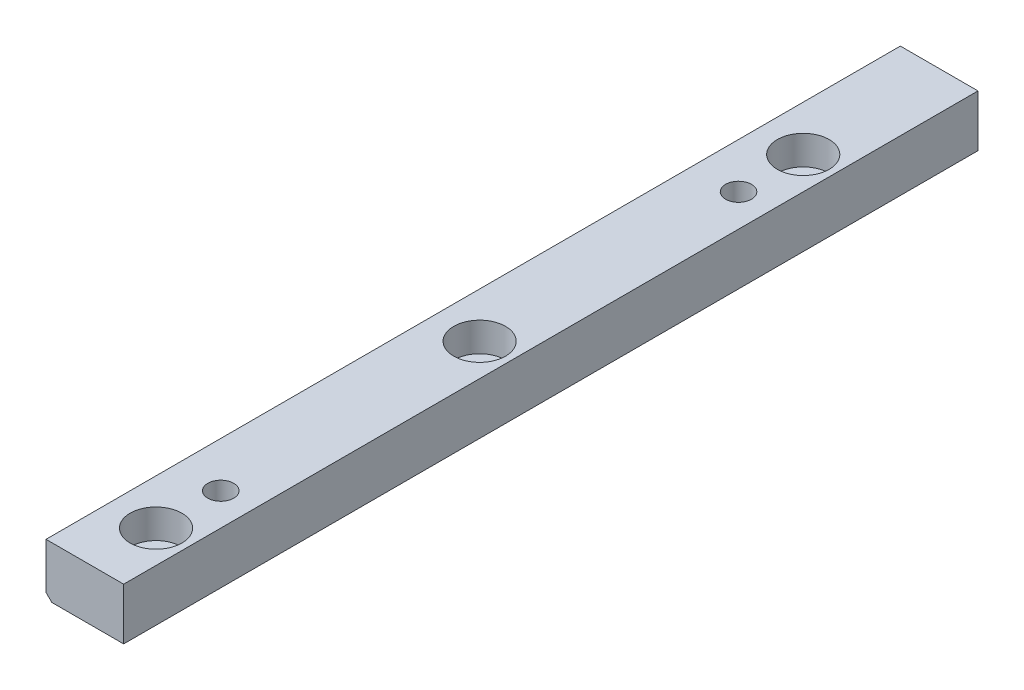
ISO-10303-21;
HEADER;
FILE_DESCRIPTION(('STEP AP214'),'2;1');
FILE_NAME('part.step','',(''),(''),'','','');
FILE_SCHEMA(('AUTOMOTIVE_DESIGN { 1 0 10303 214 1 1 1 1 }'));
ENDSEC;
DATA;
#1=APPLICATION_CONTEXT('core data for automotive mechanical design processes');
#2=APPLICATION_PROTOCOL_DEFINITION('international standard','automotive_design',2000,#1);
#3=PRODUCT_CONTEXT('',#1,'mechanical');
#4=PRODUCT('Part','Part','',(#3));
#5=PRODUCT_RELATED_PRODUCT_CATEGORY('part','',(#4));
#6=PRODUCT_DEFINITION_FORMATION('','',#4);
#7=PRODUCT_DEFINITION_CONTEXT('part definition',#1,'design');
#8=PRODUCT_DEFINITION('design','',#6,#7);
#9=PRODUCT_DEFINITION_SHAPE('','',#8);
#10=(LENGTH_UNIT() NAMED_UNIT(*) SI_UNIT(.MILLI.,.METRE.));
#11=(NAMED_UNIT(*) PLANE_ANGLE_UNIT() SI_UNIT($,.RADIAN.));
#12=(NAMED_UNIT(*) SI_UNIT($,.STERADIAN.) SOLID_ANGLE_UNIT());
#13=UNCERTAINTY_MEASURE_WITH_UNIT(LENGTH_MEASURE(1.E-05),#10,'distance_accuracy_value','');
#14=(GEOMETRIC_REPRESENTATION_CONTEXT(3) GLOBAL_UNCERTAINTY_ASSIGNED_CONTEXT((#13)) GLOBAL_UNIT_ASSIGNED_CONTEXT((#10,
#11,#12)) REPRESENTATION_CONTEXT('',''));
#15=CARTESIAN_POINT('',(0.,0.,0.));
#16=DIRECTION('',(0.,0.,1.));
#17=DIRECTION('',(1.,0.,0.));
#18=AXIS2_PLACEMENT_3D('',#15,#16,#17);
#19=CARTESIAN_POINT('',(7.,-124.,122.));
#20=DIRECTION('',(0.,1.,0.));
#21=DIRECTION('',(0.,0.,1.));
#22=AXIS2_PLACEMENT_3D('',#19,#20,#21);
#23=CYLINDRICAL_SURFACE('',#22,2.25);
#24=CARTESIAN_POINT('',(7.,0.,122.));
#25=DIRECTION('',(0.,1.,0.));
#26=DIRECTION('',(0.,0.,1.));
#27=AXIS2_PLACEMENT_3D('',#24,#25,#26);
#28=CIRCLE('',#27,2.25);
#29=CARTESIAN_POINT('',(7.,0.,124.25));
#30=VERTEX_POINT('',#29);
#31=EDGE_CURVE('E158',#30,#30,#28,.T.);
#32=ORIENTED_EDGE('',*,*,#31,.F.);
#33=EDGE_LOOP('',(#32));
#34=FACE_BOUND('',#33,.T.);
#35=CARTESIAN_POINT('',(7.,3.5,122.));
#36=DIRECTION('',(0.,1.,0.));
#37=DIRECTION('',(0.,0.,1.));
#38=AXIS2_PLACEMENT_3D('',#35,#36,#37);
#39=CIRCLE('',#38,2.25);
#40=CARTESIAN_POINT('',(7.,3.5,124.25));
#41=VERTEX_POINT('',#40);
#42=EDGE_CURVE('E36',#41,#41,#39,.F.);
#43=ORIENTED_EDGE('',*,*,#42,.F.);
#44=EDGE_LOOP('',(#43));
#45=FACE_BOUND('',#44,.T.);
#46=ADVANCED_FACE('F32',(#34,#45),#23,.F.);
#47=CARTESIAN_POINT('',(7.,-124.,72.));
#48=DIRECTION('',(0.,1.,0.));
#49=DIRECTION('',(0.,0.,1.));
#50=AXIS2_PLACEMENT_3D('',#47,#48,#49);
#51=CYLINDRICAL_SURFACE('',#50,2.25);
#52=CARTESIAN_POINT('',(7.,0.,72.));
#53=DIRECTION('',(0.,1.,0.));
#54=DIRECTION('',(0.,0.,1.));
#55=AXIS2_PLACEMENT_3D('',#52,#53,#54);
#56=CIRCLE('',#55,2.25);
#57=CARTESIAN_POINT('',(7.,0.,74.25));
#58=VERTEX_POINT('',#57);
#59=EDGE_CURVE('E161',#58,#58,#56,.T.);
#60=ORIENTED_EDGE('',*,*,#59,.F.);
#61=EDGE_LOOP('',(#60));
#62=FACE_BOUND('',#61,.T.);
#63=CARTESIAN_POINT('',(7.,3.5,72.));
#64=DIRECTION('',(0.,1.,0.));
#65=DIRECTION('',(0.,0.,1.));
#66=AXIS2_PLACEMENT_3D('',#63,#64,#65);
#67=CIRCLE('',#66,2.25);
#68=CARTESIAN_POINT('',(7.,3.5,74.25));
#69=VERTEX_POINT('',#68);
#70=EDGE_CURVE('E126',#69,#69,#67,.F.);
#71=ORIENTED_EDGE('',*,*,#70,.F.);
#72=EDGE_LOOP('',(#71));
#73=FACE_BOUND('',#72,.T.);
#74=ADVANCED_FACE('F187',(#62,#73),#51,.F.);
#75=CARTESIAN_POINT('',(7.,-124.,22.));
#76=DIRECTION('',(0.,1.,0.));
#77=DIRECTION('',(0.,0.,1.));
#78=AXIS2_PLACEMENT_3D('',#75,#76,#77);
#79=CYLINDRICAL_SURFACE('',#78,2.25);
#80=CARTESIAN_POINT('',(7.,0.,22.));
#81=DIRECTION('',(0.,1.,0.));
#82=DIRECTION('',(0.,0.,1.));
#83=AXIS2_PLACEMENT_3D('',#80,#81,#82);
#84=CIRCLE('',#83,2.25);
#85=CARTESIAN_POINT('',(7.,0.,24.25));
#86=VERTEX_POINT('',#85);
#87=EDGE_CURVE('E113',#86,#86,#84,.T.);
#88=ORIENTED_EDGE('',*,*,#87,.F.);
#89=EDGE_LOOP('',(#88));
#90=FACE_BOUND('',#89,.T.);
#91=CARTESIAN_POINT('',(7.,3.5,22.));
#92=DIRECTION('',(0.,1.,0.));
#93=DIRECTION('',(0.,0.,1.));
#94=AXIS2_PLACEMENT_3D('',#91,#92,#93);
#95=CIRCLE('',#94,2.25);
#96=CARTESIAN_POINT('',(7.,3.5,24.25));
#97=VERTEX_POINT('',#96);
#98=EDGE_CURVE('E122',#97,#97,#95,.F.);
#99=ORIENTED_EDGE('',*,*,#98,.F.);
#100=EDGE_LOOP('',(#99));
#101=FACE_BOUND('',#100,.T.);
#102=ADVANCED_FACE('F193',(#90,#101),#79,.F.);
#103=CARTESIAN_POINT('',(0.,0.900000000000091,132.));
#104=DIRECTION('',(0.707106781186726,0.707106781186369,0.));
#105=DIRECTION('',(-0.707106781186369,0.707106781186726,0.));
#106=AXIS2_PLACEMENT_3D('',#103,#104,#105);
#107=PLANE('',#106);
#108=DIRECTION('',(0.707106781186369,-0.707106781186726,0.));
#109=VECTOR('',#108,1.);
#110=CARTESIAN_POINT('',(0.,0.900000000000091,0.));
#111=LINE('',#110,#109);
#112=CARTESIAN_POINT('',(0.,0.900000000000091,0.));
#113=VERTEX_POINT('',#112);
#114=CARTESIAN_POINT('',(0.899999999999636,0.,0.));
#115=VERTEX_POINT('',#114);
#116=EDGE_CURVE('E109',#113,#115,#111,.T.);
#117=ORIENTED_EDGE('',*,*,#116,.T.);
#118=DIRECTION('',(0.,0.,-1.));
#119=VECTOR('',#118,1.);
#120=CARTESIAN_POINT('',(0.899999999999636,0.,132.));
#121=LINE('',#120,#119);
#122=CARTESIAN_POINT('',(0.899999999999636,0.,132.));
#123=VERTEX_POINT('',#122);
#124=EDGE_CURVE('E11',#123,#115,#121,.T.);
#125=ORIENTED_EDGE('',*,*,#124,.F.);
#126=DIRECTION('',(0.707106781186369,-0.707106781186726,0.));
#127=VECTOR('',#126,1.);
#128=CARTESIAN_POINT('',(0.,0.900000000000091,132.));
#129=LINE('',#128,#127);
#130=CARTESIAN_POINT('',(0.,0.900000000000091,132.));
#131=VERTEX_POINT('',#130);
#132=EDGE_CURVE('E118',#131,#123,#129,.T.);
#133=ORIENTED_EDGE('',*,*,#132,.F.);
#134=DIRECTION('',(0.,0.,-1.));
#135=VECTOR('',#134,1.);
#136=CARTESIAN_POINT('',(0.,0.900000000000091,132.));
#137=LINE('',#136,#135);
#138=EDGE_CURVE('E105',#131,#113,#137,.T.);
#139=ORIENTED_EDGE('',*,*,#138,.T.);
#140=EDGE_LOOP('',(#117,#125,#133,#139));
#141=FACE_BOUND('',#140,.T.);
#142=ADVANCED_FACE('F34',(#141),#107,.F.);
#143=CARTESIAN_POINT('',(0.899999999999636,0.,132.));
#144=DIRECTION('',(0.,1.,0.));
#145=DIRECTION('',(0.,0.,1.));
#146=AXIS2_PLACEMENT_3D('',#143,#144,#145);
#147=PLANE('',#146);
#148=CARTESIAN_POINT('',(7.,0.,112.));
#149=DIRECTION('',(0.,1.,0.));
#150=DIRECTION('',(0.,0.,1.));
#151=AXIS2_PLACEMENT_3D('',#148,#149,#150);
#152=CIRCLE('',#151,2.00000000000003);
#153=CARTESIAN_POINT('',(7.,0.,114.));
#154=VERTEX_POINT('',#153);
#155=EDGE_CURVE('E149',#154,#154,#152,.T.);
#156=ORIENTED_EDGE('',*,*,#155,.T.);
#157=EDGE_LOOP('',(#156));
#158=FACE_BOUND('',#157,.T.);
#159=CARTESIAN_POINT('',(7.,0.,32.));
#160=DIRECTION('',(0.,1.,0.));
#161=DIRECTION('',(0.,0.,1.));
#162=AXIS2_PLACEMENT_3D('',#159,#160,#161);
#163=CIRCLE('',#162,2.00000000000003);
#164=CARTESIAN_POINT('',(7.,0.,34.));
#165=VERTEX_POINT('',#164);
#166=EDGE_CURVE('E155',#165,#165,#163,.T.);
#167=ORIENTED_EDGE('',*,*,#166,.T.);
#168=EDGE_LOOP('',(#167));
#169=FACE_BOUND('',#168,.T.);
#170=ORIENTED_EDGE('',*,*,#31,.T.);
#171=EDGE_LOOP('',(#170));
#172=FACE_BOUND('',#171,.T.);
#173=ORIENTED_EDGE('',*,*,#59,.T.);
#174=EDGE_LOOP('',(#173));
#175=FACE_BOUND('',#174,.T.);
#176=ORIENTED_EDGE('',*,*,#87,.T.);
#177=EDGE_LOOP('',(#176));
#178=FACE_BOUND('',#177,.T.);
#179=DIRECTION('',(1.,0.,0.));
#180=VECTOR('',#179,1.);
#181=CARTESIAN_POINT('',(0.899999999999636,0.,0.));
#182=LINE('',#181,#180);
#183=CARTESIAN_POINT('',(11.9999999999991,0.,0.));
#184=VERTEX_POINT('',#183);
#185=EDGE_CURVE('E112',#115,#184,#182,.T.);
#186=ORIENTED_EDGE('',*,*,#185,.T.);
#187=DIRECTION('',(0.,0.,-1.));
#188=VECTOR('',#187,1.);
#189=CARTESIAN_POINT('',(11.9999999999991,0.,132.));
#190=LINE('',#189,#188);
#191=CARTESIAN_POINT('',(11.9999999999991,0.,132.));
#192=VERTEX_POINT('',#191);
#193=EDGE_CURVE('E42',#192,#184,#190,.T.);
#194=ORIENTED_EDGE('',*,*,#193,.F.);
#195=DIRECTION('',(1.,0.,0.));
#196=VECTOR('',#195,1.);
#197=CARTESIAN_POINT('',(0.899999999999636,0.,132.));
#198=LINE('',#197,#196);
#199=EDGE_CURVE('E85',#123,#192,#198,.T.);
#200=ORIENTED_EDGE('',*,*,#199,.F.);
#201=ORIENTED_EDGE('',*,*,#124,.T.);
#202=EDGE_LOOP('',(#186,#194,#200,#201));
#203=FACE_BOUND('',#202,.T.);
#204=ADVANCED_FACE('F170',(#158,#169,#172,#175,#178,#203),#147,.F.);
#205=CARTESIAN_POINT('',(11.9999999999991,0.,132.));
#206=DIRECTION('',(-1.,0.,0.));
#207=DIRECTION('',(0.,0.,1.));
#208=AXIS2_PLACEMENT_3D('',#205,#206,#207);
#209=PLANE('',#208);
#210=DIRECTION('',(0.,1.,0.));
#211=VECTOR('',#210,1.);
#212=CARTESIAN_POINT('',(11.9999999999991,0.,0.));
#213=LINE('',#212,#211);
#214=CARTESIAN_POINT('',(11.9999999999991,8.,0.));
#215=VERTEX_POINT('',#214);
#216=EDGE_CURVE('E100',#184,#215,#213,.T.);
#217=ORIENTED_EDGE('',*,*,#216,.T.);
#218=DIRECTION('',(0.,0.,-1.));
#219=VECTOR('',#218,1.);
#220=CARTESIAN_POINT('',(11.9999999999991,8.,132.));
#221=LINE('',#220,#219);
#222=CARTESIAN_POINT('',(11.9999999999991,8.,132.));
#223=VERTEX_POINT('',#222);
#224=EDGE_CURVE('E97',#223,#215,#221,.T.);
#225=ORIENTED_EDGE('',*,*,#224,.F.);
#226=DIRECTION('',(0.,1.,0.));
#227=VECTOR('',#226,1.);
#228=CARTESIAN_POINT('',(11.9999999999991,0.,132.));
#229=LINE('',#228,#227);
#230=EDGE_CURVE('E89',#192,#223,#229,.T.);
#231=ORIENTED_EDGE('',*,*,#230,.F.);
#232=ORIENTED_EDGE('',*,*,#193,.T.);
#233=EDGE_LOOP('',(#217,#225,#231,#232));
#234=FACE_BOUND('',#233,.T.);
#235=ADVANCED_FACE('F98',(#234),#209,.F.);
#236=CARTESIAN_POINT('',(-9.09494701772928E-13,8.,132.));
#237=DIRECTION('',(0.,-1.,0.));
#238=DIRECTION('',(0.,0.,-1.));
#239=AXIS2_PLACEMENT_3D('',#236,#237,#238);
#240=PLANE('',#239);
#241=CARTESIAN_POINT('',(7.,8.,122.));
#242=DIRECTION('',(0.,1.,0.));
#243=DIRECTION('',(0.,0.,1.));
#244=AXIS2_PLACEMENT_3D('',#241,#242,#243);
#245=CIRCLE('',#244,4.);
#246=CARTESIAN_POINT('',(7.,8.,126.));
#247=VERTEX_POINT('',#246);
#248=EDGE_CURVE('E142',#247,#247,#245,.T.);
#249=ORIENTED_EDGE('',*,*,#248,.F.);
#250=EDGE_LOOP('',(#249));
#251=FACE_BOUND('',#250,.T.);
#252=CARTESIAN_POINT('',(7.,8.,72.));
#253=DIRECTION('',(0.,1.,0.));
#254=DIRECTION('',(0.,0.,1.));
#255=AXIS2_PLACEMENT_3D('',#252,#253,#254);
#256=CIRCLE('',#255,4.);
#257=CARTESIAN_POINT('',(7.,8.,76.));
#258=VERTEX_POINT('',#257);
#259=EDGE_CURVE('E135',#258,#258,#256,.T.);
#260=ORIENTED_EDGE('',*,*,#259,.F.);
#261=EDGE_LOOP('',(#260));
#262=FACE_BOUND('',#261,.T.);
#263=CARTESIAN_POINT('',(7.,8.,22.));
#264=DIRECTION('',(0.,1.,0.));
#265=DIRECTION('',(0.,0.,1.));
#266=AXIS2_PLACEMENT_3D('',#263,#264,#265);
#267=CIRCLE('',#266,4.);
#268=CARTESIAN_POINT('',(7.,8.,26.));
#269=VERTEX_POINT('',#268);
#270=EDGE_CURVE('E128',#269,#269,#267,.T.);
#271=ORIENTED_EDGE('',*,*,#270,.F.);
#272=EDGE_LOOP('',(#271));
#273=FACE_BOUND('',#272,.T.);
#274=CARTESIAN_POINT('',(7.,8.,112.));
#275=DIRECTION('',(0.,1.,0.));
#276=DIRECTION('',(0.,0.,1.));
#277=AXIS2_PLACEMENT_3D('',#274,#275,#276);
#278=CIRCLE('',#277,2.00000000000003);
#279=CARTESIAN_POINT('',(7.,8.,114.));
#280=VERTEX_POINT('',#279);
#281=EDGE_CURVE('E124',#280,#280,#278,.T.);
#282=ORIENTED_EDGE('',*,*,#281,.F.);
#283=EDGE_LOOP('',(#282));
#284=FACE_BOUND('',#283,.T.);
#285=CARTESIAN_POINT('',(7.,8.,32.));
#286=DIRECTION('',(0.,1.,0.));
#287=DIRECTION('',(0.,0.,1.));
#288=AXIS2_PLACEMENT_3D('',#285,#286,#287);
#289=CIRCLE('',#288,2.00000000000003);
#290=CARTESIAN_POINT('',(7.,8.,34.));
#291=VERTEX_POINT('',#290);
#292=EDGE_CURVE('E152',#291,#291,#289,.T.);
#293=ORIENTED_EDGE('',*,*,#292,.F.);
#294=EDGE_LOOP('',(#293));
#295=FACE_BOUND('',#294,.T.);
#296=DIRECTION('',(-1.,0.,0.));
#297=VECTOR('',#296,1.);
#298=CARTESIAN_POINT('',(-9.09494701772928E-13,8.,0.));
#299=LINE('',#298,#297);
#300=CARTESIAN_POINT('',(-9.09494701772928E-13,8.,0.));
#301=VERTEX_POINT('',#300);
#302=EDGE_CURVE('E71',#215,#301,#299,.T.);
#303=ORIENTED_EDGE('',*,*,#302,.T.);
#304=DIRECTION('',(0.,0.,-1.));
#305=VECTOR('',#304,1.);
#306=CARTESIAN_POINT('',(-9.09494701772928E-13,8.,132.));
#307=LINE('',#306,#305);
#308=CARTESIAN_POINT('',(-9.09494701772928E-13,8.,132.));
#309=VERTEX_POINT('',#308);
#310=EDGE_CURVE('E101',#309,#301,#307,.T.);
#311=ORIENTED_EDGE('',*,*,#310,.F.);
#312=DIRECTION('',(-1.,0.,0.));
#313=VECTOR('',#312,1.);
#314=CARTESIAN_POINT('',(-9.09494701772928E-13,8.,132.));
#315=LINE('',#314,#313);
#316=EDGE_CURVE('E93',#223,#309,#315,.T.);
#317=ORIENTED_EDGE('',*,*,#316,.F.);
#318=ORIENTED_EDGE('',*,*,#224,.T.);
#319=EDGE_LOOP('',(#303,#311,#317,#318));
#320=FACE_BOUND('',#319,.T.);
#321=ADVANCED_FACE('F103',(#251,#262,#273,#284,#295,#320),#240,.F.);
#322=CARTESIAN_POINT('',(0.,0.900000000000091,132.));
#323=DIRECTION('',(1.,1.28097845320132E-13,0.));
#324=DIRECTION('',(-1.28097845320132E-13,1.,0.));
#325=AXIS2_PLACEMENT_3D('',#322,#323,#324);
#326=PLANE('',#325);
#327=DIRECTION('',(1.28097845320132E-13,-1.,0.));
#328=VECTOR('',#327,1.);
#329=CARTESIAN_POINT('',(0.,0.900000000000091,0.));
#330=LINE('',#329,#328);
#331=EDGE_CURVE('E77',#301,#113,#330,.T.);
#332=ORIENTED_EDGE('',*,*,#331,.T.);
#333=ORIENTED_EDGE('',*,*,#138,.F.);
#334=DIRECTION('',(1.28097845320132E-13,-1.,0.));
#335=VECTOR('',#334,1.);
#336=CARTESIAN_POINT('',(0.,0.900000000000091,132.));
#337=LINE('',#336,#335);
#338=EDGE_CURVE('E51',#309,#131,#337,.T.);
#339=ORIENTED_EDGE('',*,*,#338,.F.);
#340=ORIENTED_EDGE('',*,*,#310,.T.);
#341=EDGE_LOOP('',(#332,#333,#339,#340));
#342=FACE_BOUND('',#341,.T.);
#343=ADVANCED_FACE('F183',(#342),#326,.F.);
#344=CARTESIAN_POINT('',(0.899999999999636,0.,132.));
#345=DIRECTION('',(0.,0.,1.));
#346=DIRECTION('',(1.,0.,0.));
#347=AXIS2_PLACEMENT_3D('',#344,#345,#346);
#348=PLANE('',#347);
#349=ORIENTED_EDGE('',*,*,#132,.T.);
#350=ORIENTED_EDGE('',*,*,#199,.T.);
#351=ORIENTED_EDGE('',*,*,#230,.T.);
#352=ORIENTED_EDGE('',*,*,#316,.T.);
#353=ORIENTED_EDGE('',*,*,#338,.T.);
#354=EDGE_LOOP('',(#349,#350,#351,#352,#353));
#355=FACE_BOUND('',#354,.T.);
#356=ADVANCED_FACE('F91',(#355),#348,.T.);
#357=CARTESIAN_POINT('',(0.899999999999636,0.,0.));
#358=DIRECTION('',(0.,0.,1.));
#359=DIRECTION('',(1.,0.,0.));
#360=AXIS2_PLACEMENT_3D('',#357,#358,#359);
#361=PLANE('',#360);
#362=ORIENTED_EDGE('',*,*,#116,.F.);
#363=ORIENTED_EDGE('',*,*,#331,.F.);
#364=ORIENTED_EDGE('',*,*,#302,.F.);
#365=ORIENTED_EDGE('',*,*,#216,.F.);
#366=ORIENTED_EDGE('',*,*,#185,.F.);
#367=EDGE_LOOP('',(#362,#363,#364,#365,#366));
#368=FACE_BOUND('',#367,.T.);
#369=ADVANCED_FACE('F172',(#368),#361,.F.);
#370=CARTESIAN_POINT('',(7.,-124.,32.));
#371=DIRECTION('',(0.,1.,0.));
#372=DIRECTION('',(0.,0.,1.));
#373=AXIS2_PLACEMENT_3D('',#370,#371,#372);
#374=CYLINDRICAL_SURFACE('',#373,2.00000000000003);
#375=ORIENTED_EDGE('',*,*,#292,.T.);
#376=EDGE_LOOP('',(#375));
#377=FACE_BOUND('',#376,.T.);
#378=ORIENTED_EDGE('',*,*,#166,.F.);
#379=EDGE_LOOP('',(#378));
#380=FACE_BOUND('',#379,.T.);
#381=ADVANCED_FACE('F174',(#377,#380),#374,.F.);
#382=CARTESIAN_POINT('',(7.,-124.,112.));
#383=DIRECTION('',(0.,1.,0.));
#384=DIRECTION('',(0.,0.,1.));
#385=AXIS2_PLACEMENT_3D('',#382,#383,#384);
#386=CYLINDRICAL_SURFACE('',#385,2.00000000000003);
#387=ORIENTED_EDGE('',*,*,#281,.T.);
#388=EDGE_LOOP('',(#387));
#389=FACE_BOUND('',#388,.T.);
#390=ORIENTED_EDGE('',*,*,#155,.F.);
#391=EDGE_LOOP('',(#390));
#392=FACE_BOUND('',#391,.T.);
#393=ADVANCED_FACE('F180',(#389,#392),#386,.F.);
#394=CARTESIAN_POINT('',(7.,3.5,22.));
#395=DIRECTION('',(0.,1.,0.));
#396=DIRECTION('',(0.,0.,1.));
#397=AXIS2_PLACEMENT_3D('',#394,#395,#396);
#398=PLANE('',#397);
#399=CARTESIAN_POINT('',(7.,3.5,22.));
#400=DIRECTION('',(0.,1.,0.));
#401=DIRECTION('',(0.,0.,1.));
#402=AXIS2_PLACEMENT_3D('',#399,#400,#401);
#403=CIRCLE('',#402,4.);
#404=CARTESIAN_POINT('',(7.,3.5,26.));
#405=VERTEX_POINT('',#404);
#406=EDGE_CURVE('E125',#405,#405,#403,.T.);
#407=ORIENTED_EDGE('',*,*,#406,.T.);
#408=EDGE_LOOP('',(#407));
#409=FACE_BOUND('',#408,.T.);
#410=ORIENTED_EDGE('',*,*,#98,.T.);
#411=EDGE_LOOP('',(#410));
#412=FACE_BOUND('',#411,.T.);
#413=ADVANCED_FACE('F209',(#409,#412),#398,.T.);
#414=CARTESIAN_POINT('',(7.,3.5,22.));
#415=DIRECTION('',(0.,1.,0.));
#416=DIRECTION('',(0.,0.,1.));
#417=AXIS2_PLACEMENT_3D('',#414,#415,#416);
#418=CYLINDRICAL_SURFACE('',#417,4.);
#419=ORIENTED_EDGE('',*,*,#406,.F.);
#420=EDGE_LOOP('',(#419));
#421=FACE_BOUND('',#420,.T.);
#422=ORIENTED_EDGE('',*,*,#270,.T.);
#423=EDGE_LOOP('',(#422));
#424=FACE_BOUND('',#423,.T.);
#425=ADVANCED_FACE('F211',(#421,#424),#418,.F.);
#426=CARTESIAN_POINT('',(7.,3.5,72.));
#427=DIRECTION('',(0.,1.,0.));
#428=DIRECTION('',(0.,0.,1.));
#429=AXIS2_PLACEMENT_3D('',#426,#427,#428);
#430=PLANE('',#429);
#431=CARTESIAN_POINT('',(7.,3.5,72.));
#432=DIRECTION('',(0.,1.,0.));
#433=DIRECTION('',(0.,0.,1.));
#434=AXIS2_PLACEMENT_3D('',#431,#432,#433);
#435=CIRCLE('',#434,4.);
#436=CARTESIAN_POINT('',(7.,3.5,76.));
#437=VERTEX_POINT('',#436);
#438=EDGE_CURVE('E129',#437,#437,#435,.T.);
#439=ORIENTED_EDGE('',*,*,#438,.T.);
#440=EDGE_LOOP('',(#439));
#441=FACE_BOUND('',#440,.T.);
#442=ORIENTED_EDGE('',*,*,#70,.T.);
#443=EDGE_LOOP('',(#442));
#444=FACE_BOUND('',#443,.T.);
#445=ADVANCED_FACE('F218',(#441,#444),#430,.T.);
#446=CARTESIAN_POINT('',(7.,3.5,72.));
#447=DIRECTION('',(0.,1.,0.));
#448=DIRECTION('',(0.,0.,1.));
#449=AXIS2_PLACEMENT_3D('',#446,#447,#448);
#450=CYLINDRICAL_SURFACE('',#449,4.);
#451=ORIENTED_EDGE('',*,*,#438,.F.);
#452=EDGE_LOOP('',(#451));
#453=FACE_BOUND('',#452,.T.);
#454=ORIENTED_EDGE('',*,*,#259,.T.);
#455=EDGE_LOOP('',(#454));
#456=FACE_BOUND('',#455,.T.);
#457=ADVANCED_FACE('F223',(#453,#456),#450,.F.);
#458=CARTESIAN_POINT('',(7.,3.5,122.));
#459=DIRECTION('',(0.,1.,0.));
#460=DIRECTION('',(0.,0.,1.));
#461=AXIS2_PLACEMENT_3D('',#458,#459,#460);
#462=PLANE('',#461);
#463=CARTESIAN_POINT('',(7.,3.5,122.));
#464=DIRECTION('',(0.,1.,0.));
#465=DIRECTION('',(0.,0.,1.));
#466=AXIS2_PLACEMENT_3D('',#463,#464,#465);
#467=CIRCLE('',#466,4.);
#468=CARTESIAN_POINT('',(7.,3.5,126.));
#469=VERTEX_POINT('',#468);
#470=EDGE_CURVE('E241',#469,#469,#467,.T.);
#471=ORIENTED_EDGE('',*,*,#470,.T.);
#472=EDGE_LOOP('',(#471));
#473=FACE_BOUND('',#472,.T.);
#474=ORIENTED_EDGE('',*,*,#42,.T.);
#475=EDGE_LOOP('',(#474));
#476=FACE_BOUND('',#475,.T.);
#477=ADVANCED_FACE('F226',(#473,#476),#462,.T.);
#478=CARTESIAN_POINT('',(7.,3.5,122.));
#479=DIRECTION('',(0.,1.,0.));
#480=DIRECTION('',(0.,0.,1.));
#481=AXIS2_PLACEMENT_3D('',#478,#479,#480);
#482=CYLINDRICAL_SURFACE('',#481,4.);
#483=ORIENTED_EDGE('',*,*,#470,.F.);
#484=EDGE_LOOP('',(#483));
#485=FACE_BOUND('',#484,.T.);
#486=ORIENTED_EDGE('',*,*,#248,.T.);
#487=EDGE_LOOP('',(#486));
#488=FACE_BOUND('',#487,.T.);
#489=ADVANCED_FACE('F230',(#485,#488),#482,.F.);
#490=CLOSED_SHELL('',(#46,#74,#102,#142,#204,#235,#321,#343,#356,#369,#381,#393,#413,#425,#445,
#457,#477,#489));
#491=MANIFOLD_SOLID_BREP('B2',#490);
#492=ADVANCED_BREP_SHAPE_REPRESENTATION('',(#18,#491),#14);
#493=SHAPE_DEFINITION_REPRESENTATION(#9,#492);
ENDSEC;
END-ISO-10303-21;
